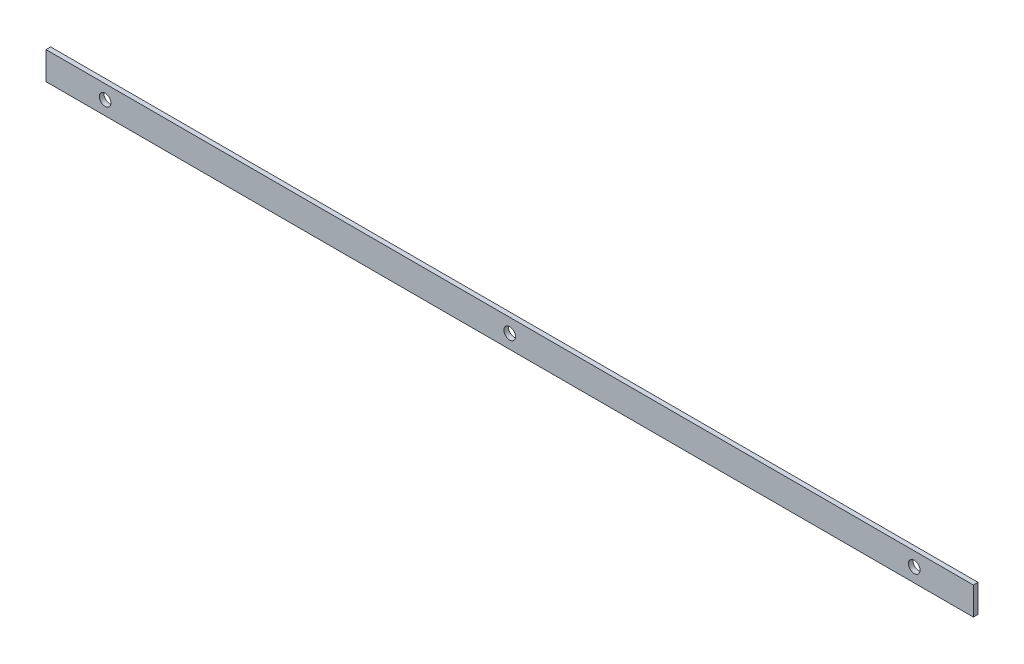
ISO-10303-21;
HEADER;
FILE_DESCRIPTION(('STEP AP214'),'2;1');
FILE_NAME('part.step','',(''),(''),'','','');
FILE_SCHEMA(('AUTOMOTIVE_DESIGN { 1 0 10303 214 1 1 1 1 }'));
ENDSEC;
DATA;
#1=APPLICATION_CONTEXT('core data for automotive mechanical design processes');
#2=APPLICATION_PROTOCOL_DEFINITION('international standard','automotive_design',2000,#1);
#3=PRODUCT_CONTEXT('',#1,'mechanical');
#4=PRODUCT('Part','Part','',(#3));
#5=PRODUCT_RELATED_PRODUCT_CATEGORY('part','',(#4));
#6=PRODUCT_DEFINITION_FORMATION('','',#4);
#7=PRODUCT_DEFINITION_CONTEXT('part definition',#1,'design');
#8=PRODUCT_DEFINITION('design','',#6,#7);
#9=PRODUCT_DEFINITION_SHAPE('','',#8);
#10=(LENGTH_UNIT() NAMED_UNIT(*) SI_UNIT(.MILLI.,.METRE.));
#11=(NAMED_UNIT(*) PLANE_ANGLE_UNIT() SI_UNIT($,.RADIAN.));
#12=(NAMED_UNIT(*) SI_UNIT($,.STERADIAN.) SOLID_ANGLE_UNIT());
#13=UNCERTAINTY_MEASURE_WITH_UNIT(LENGTH_MEASURE(1.E-05),#10,'distance_accuracy_value','');
#14=(GEOMETRIC_REPRESENTATION_CONTEXT(3) GLOBAL_UNCERTAINTY_ASSIGNED_CONTEXT((#13)) GLOBAL_UNIT_ASSIGNED_CONTEXT((#10,
#11,#12)) REPRESENTATION_CONTEXT('',''));
#15=CARTESIAN_POINT('',(0.,0.,0.));
#16=DIRECTION('',(0.,0.,1.));
#17=DIRECTION('',(1.,0.,0.));
#18=AXIS2_PLACEMENT_3D('',#15,#16,#17);
#19=CARTESIAN_POINT('',(0.,0.,4.));
#20=DIRECTION('',(-1.,0.,0.));
#21=DIRECTION('',(0.,0.,1.));
#22=AXIS2_PLACEMENT_3D('',#19,#20,#21);
#23=PLANE('',#22);
#24=DIRECTION('',(0.,1.,0.));
#25=VECTOR('',#24,1.);
#26=CARTESIAN_POINT('',(0.,0.,0.));
#27=LINE('',#26,#25);
#28=CARTESIAN_POINT('',(0.,0.,0.));
#29=VERTEX_POINT('',#28);
#30=CARTESIAN_POINT('',(0.,24.,0.));
#31=VERTEX_POINT('',#30);
#32=EDGE_CURVE('E71',#29,#31,#27,.T.);
#33=ORIENTED_EDGE('',*,*,#32,.T.);
#34=DIRECTION('',(0.,0.,-1.));
#35=VECTOR('',#34,1.);
#36=CARTESIAN_POINT('',(0.,24.,4.));
#37=LINE('',#36,#35);
#38=CARTESIAN_POINT('',(0.,24.,4.));
#39=VERTEX_POINT('',#38);
#40=EDGE_CURVE('E11',#39,#31,#37,.T.);
#41=ORIENTED_EDGE('',*,*,#40,.F.);
#42=DIRECTION('',(0.,1.,0.));
#43=VECTOR('',#42,1.);
#44=CARTESIAN_POINT('',(0.,0.,4.));
#45=LINE('',#44,#43);
#46=CARTESIAN_POINT('',(0.,0.,4.));
#47=VERTEX_POINT('',#46);
#48=EDGE_CURVE('E94',#47,#39,#45,.T.);
#49=ORIENTED_EDGE('',*,*,#48,.F.);
#50=DIRECTION('',(0.,0.,-1.));
#51=VECTOR('',#50,1.);
#52=CARTESIAN_POINT('',(0.,0.,4.));
#53=LINE('',#52,#51);
#54=EDGE_CURVE('E83',#47,#29,#53,.T.);
#55=ORIENTED_EDGE('',*,*,#54,.T.);
#56=EDGE_LOOP('',(#33,#41,#49,#55));
#57=FACE_BOUND('',#56,.T.);
#58=ADVANCED_FACE('F27',(#57),#23,.F.);
#59=CARTESIAN_POINT('',(0.,24.,4.));
#60=DIRECTION('',(0.,-1.,0.));
#61=DIRECTION('',(1.,0.,0.));
#62=AXIS2_PLACEMENT_3D('',#59,#60,#61);
#63=PLANE('',#62);
#64=DIRECTION('',(-1.,0.,0.));
#65=VECTOR('',#64,1.);
#66=CARTESIAN_POINT('',(0.,24.,0.));
#67=LINE('',#66,#65);
#68=CARTESIAN_POINT('',(-800.,23.9999999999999,0.));
#69=VERTEX_POINT('',#68);
#70=EDGE_CURVE('E67',#31,#69,#67,.T.);
#71=ORIENTED_EDGE('',*,*,#70,.T.);
#72=DIRECTION('',(0.,0.,-1.));
#73=VECTOR('',#72,1.);
#74=CARTESIAN_POINT('',(-800.,23.9999999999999,4.));
#75=LINE('',#74,#73);
#76=CARTESIAN_POINT('',(-800.,23.9999999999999,4.));
#77=VERTEX_POINT('',#76);
#78=EDGE_CURVE('E34',#77,#69,#75,.T.);
#79=ORIENTED_EDGE('',*,*,#78,.F.);
#80=DIRECTION('',(-1.,0.,0.));
#81=VECTOR('',#80,1.);
#82=CARTESIAN_POINT('',(0.,24.,4.));
#83=LINE('',#82,#81);
#84=EDGE_CURVE('E79',#39,#77,#83,.T.);
#85=ORIENTED_EDGE('',*,*,#84,.F.);
#86=ORIENTED_EDGE('',*,*,#40,.T.);
#87=EDGE_LOOP('',(#71,#79,#85,#86));
#88=FACE_BOUND('',#87,.T.);
#89=ADVANCED_FACE('F78',(#88),#63,.F.);
#90=CARTESIAN_POINT('',(-800.,0.,4.));
#91=DIRECTION('',(1.,0.,0.));
#92=DIRECTION('',(0.,0.,-1.));
#93=AXIS2_PLACEMENT_3D('',#90,#91,#92);
#94=PLANE('',#93);
#95=DIRECTION('',(0.,-1.,0.));
#96=VECTOR('',#95,1.);
#97=CARTESIAN_POINT('',(-800.,0.,0.));
#98=LINE('',#97,#96);
#99=CARTESIAN_POINT('',(-800.,0.,0.));
#100=VERTEX_POINT('',#99);
#101=EDGE_CURVE('E72',#69,#100,#98,.T.);
#102=ORIENTED_EDGE('',*,*,#101,.T.);
#103=DIRECTION('',(0.,0.,-1.));
#104=VECTOR('',#103,1.);
#105=CARTESIAN_POINT('',(-800.,0.,4.));
#106=LINE('',#105,#104);
#107=CARTESIAN_POINT('',(-800.,0.,4.));
#108=VERTEX_POINT('',#107);
#109=EDGE_CURVE('E100',#108,#100,#106,.T.);
#110=ORIENTED_EDGE('',*,*,#109,.F.);
#111=DIRECTION('',(0.,-1.,0.));
#112=VECTOR('',#111,1.);
#113=CARTESIAN_POINT('',(-800.,0.,4.));
#114=LINE('',#113,#112);
#115=EDGE_CURVE('E46',#77,#108,#114,.T.);
#116=ORIENTED_EDGE('',*,*,#115,.F.);
#117=ORIENTED_EDGE('',*,*,#78,.T.);
#118=EDGE_LOOP('',(#102,#110,#116,#117));
#119=FACE_BOUND('',#118,.T.);
#120=ADVANCED_FACE('F103',(#119),#94,.F.);
#121=CARTESIAN_POINT('',(0.,0.,4.));
#122=DIRECTION('',(0.,1.,0.));
#123=DIRECTION('',(-1.,0.,0.));
#124=AXIS2_PLACEMENT_3D('',#121,#122,#123);
#125=PLANE('',#124);
#126=DIRECTION('',(1.,0.,0.));
#127=VECTOR('',#126,1.);
#128=CARTESIAN_POINT('',(0.,0.,0.));
#129=LINE('',#128,#127);
#130=EDGE_CURVE('E92',#100,#29,#129,.T.);
#131=ORIENTED_EDGE('',*,*,#130,.T.);
#132=ORIENTED_EDGE('',*,*,#54,.F.);
#133=DIRECTION('',(1.,0.,0.));
#134=VECTOR('',#133,1.);
#135=CARTESIAN_POINT('',(0.,0.,4.));
#136=LINE('',#135,#134);
#137=EDGE_CURVE('E41',#108,#47,#136,.T.);
#138=ORIENTED_EDGE('',*,*,#137,.F.);
#139=ORIENTED_EDGE('',*,*,#109,.T.);
#140=EDGE_LOOP('',(#131,#132,#138,#139));
#141=FACE_BOUND('',#140,.T.);
#142=ADVANCED_FACE('F105',(#141),#125,.F.);
#143=CARTESIAN_POINT('',(0.,24.,4.));
#144=DIRECTION('',(0.,0.,1.));
#145=DIRECTION('',(1.,0.,0.));
#146=AXIS2_PLACEMENT_3D('',#143,#144,#145);
#147=PLANE('',#146);
#148=CARTESIAN_POINT('',(-51.,12.,4.));
#149=DIRECTION('',(0.,0.,1.));
#150=DIRECTION('',(1.,0.,0.));
#151=AXIS2_PLACEMENT_3D('',#148,#149,#150);
#152=CIRCLE('',#151,5.);
#153=CARTESIAN_POINT('',(-46.,12.,4.));
#154=VERTEX_POINT('',#153);
#155=EDGE_CURVE('E170',#154,#154,#152,.T.);
#156=ORIENTED_EDGE('',*,*,#155,.F.);
#157=EDGE_LOOP('',(#156));
#158=FACE_BOUND('',#157,.T.);
#159=CARTESIAN_POINT('',(-400.,12.,4.));
#160=DIRECTION('',(0.,0.,1.));
#161=DIRECTION('',(1.,0.,0.));
#162=AXIS2_PLACEMENT_3D('',#159,#160,#161);
#163=CIRCLE('',#162,4.99999999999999);
#164=CARTESIAN_POINT('',(-395.,12.,4.));
#165=VERTEX_POINT('',#164);
#166=EDGE_CURVE('E172',#165,#165,#163,.T.);
#167=ORIENTED_EDGE('',*,*,#166,.F.);
#168=EDGE_LOOP('',(#167));
#169=FACE_BOUND('',#168,.T.);
#170=CARTESIAN_POINT('',(-749.,12.,4.));
#171=DIRECTION('',(0.,0.,1.));
#172=DIRECTION('',(1.,0.,0.));
#173=AXIS2_PLACEMENT_3D('',#170,#171,#172);
#174=CIRCLE('',#173,5.00000000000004);
#175=CARTESIAN_POINT('',(-744.,12.,4.));
#176=VERTEX_POINT('',#175);
#177=EDGE_CURVE('E87',#176,#176,#174,.T.);
#178=ORIENTED_EDGE('',*,*,#177,.F.);
#179=EDGE_LOOP('',(#178));
#180=FACE_BOUND('',#179,.T.);
#181=ORIENTED_EDGE('',*,*,#48,.T.);
#182=ORIENTED_EDGE('',*,*,#84,.T.);
#183=ORIENTED_EDGE('',*,*,#115,.T.);
#184=ORIENTED_EDGE('',*,*,#137,.T.);
#185=EDGE_LOOP('',(#181,#182,#183,#184));
#186=FACE_BOUND('',#185,.T.);
#187=ADVANCED_FACE('F106',(#158,#169,#180,#186),#147,.T.);
#188=CARTESIAN_POINT('',(0.,24.,0.));
#189=DIRECTION('',(0.,0.,1.));
#190=DIRECTION('',(1.,0.,0.));
#191=AXIS2_PLACEMENT_3D('',#188,#189,#190);
#192=PLANE('',#191);
#193=CARTESIAN_POINT('',(-51.,12.,0.));
#194=DIRECTION('',(0.,0.,1.));
#195=DIRECTION('',(1.,0.,0.));
#196=AXIS2_PLACEMENT_3D('',#193,#194,#195);
#197=CIRCLE('',#196,5.);
#198=CARTESIAN_POINT('',(-46.,12.,0.));
#199=VERTEX_POINT('',#198);
#200=EDGE_CURVE('E168',#199,#199,#197,.T.);
#201=ORIENTED_EDGE('',*,*,#200,.T.);
#202=EDGE_LOOP('',(#201));
#203=FACE_BOUND('',#202,.T.);
#204=CARTESIAN_POINT('',(-400.,12.,0.));
#205=DIRECTION('',(0.,0.,1.));
#206=DIRECTION('',(1.,0.,0.));
#207=AXIS2_PLACEMENT_3D('',#204,#205,#206);
#208=CIRCLE('',#207,4.99999999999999);
#209=CARTESIAN_POINT('',(-395.,12.,0.));
#210=VERTEX_POINT('',#209);
#211=EDGE_CURVE('E177',#210,#210,#208,.T.);
#212=ORIENTED_EDGE('',*,*,#211,.T.);
#213=EDGE_LOOP('',(#212));
#214=FACE_BOUND('',#213,.T.);
#215=CARTESIAN_POINT('',(-749.,12.,0.));
#216=DIRECTION('',(0.,0.,1.));
#217=DIRECTION('',(1.,0.,0.));
#218=AXIS2_PLACEMENT_3D('',#215,#216,#217);
#219=CIRCLE('',#218,5.00000000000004);
#220=CARTESIAN_POINT('',(-744.,12.,0.));
#221=VERTEX_POINT('',#220);
#222=EDGE_CURVE('E84',#221,#221,#219,.T.);
#223=ORIENTED_EDGE('',*,*,#222,.T.);
#224=EDGE_LOOP('',(#223));
#225=FACE_BOUND('',#224,.T.);
#226=ORIENTED_EDGE('',*,*,#32,.F.);
#227=ORIENTED_EDGE('',*,*,#130,.F.);
#228=ORIENTED_EDGE('',*,*,#101,.F.);
#229=ORIENTED_EDGE('',*,*,#70,.F.);
#230=EDGE_LOOP('',(#226,#227,#228,#229));
#231=FACE_BOUND('',#230,.T.);
#232=ADVANCED_FACE('F68',(#203,#214,#225,#231),#192,.F.);
#233=CARTESIAN_POINT('',(-749.,12.,0.));
#234=DIRECTION('',(0.,0.,1.));
#235=DIRECTION('',(1.,0.,0.));
#236=AXIS2_PLACEMENT_3D('',#233,#234,#235);
#237=CYLINDRICAL_SURFACE('',#236,5.00000000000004);
#238=ORIENTED_EDGE('',*,*,#222,.F.);
#239=EDGE_LOOP('',(#238));
#240=FACE_BOUND('',#239,.T.);
#241=ORIENTED_EDGE('',*,*,#177,.T.);
#242=EDGE_LOOP('',(#241));
#243=FACE_BOUND('',#242,.T.);
#244=ADVANCED_FACE('F114',(#240,#243),#237,.F.);
#245=CARTESIAN_POINT('',(-400.,12.,0.));
#246=DIRECTION('',(0.,0.,1.));
#247=DIRECTION('',(1.,0.,0.));
#248=AXIS2_PLACEMENT_3D('',#245,#246,#247);
#249=CYLINDRICAL_SURFACE('',#248,4.99999999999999);
#250=ORIENTED_EDGE('',*,*,#211,.F.);
#251=EDGE_LOOP('',(#250));
#252=FACE_BOUND('',#251,.T.);
#253=ORIENTED_EDGE('',*,*,#166,.T.);
#254=EDGE_LOOP('',(#253));
#255=FACE_BOUND('',#254,.T.);
#256=ADVANCED_FACE('F147',(#252,#255),#249,.F.);
#257=CARTESIAN_POINT('',(-51.,12.,0.));
#258=DIRECTION('',(0.,0.,1.));
#259=DIRECTION('',(1.,0.,0.));
#260=AXIS2_PLACEMENT_3D('',#257,#258,#259);
#261=CYLINDRICAL_SURFACE('',#260,5.);
#262=ORIENTED_EDGE('',*,*,#200,.F.);
#263=EDGE_LOOP('',(#262));
#264=FACE_BOUND('',#263,.T.);
#265=ORIENTED_EDGE('',*,*,#155,.T.);
#266=EDGE_LOOP('',(#265));
#267=FACE_BOUND('',#266,.T.);
#268=ADVANCED_FACE('F155',(#264,#267),#261,.F.);
#269=CLOSED_SHELL('',(#58,#89,#120,#142,#187,#232,#244,#256,#268));
#270=MANIFOLD_SOLID_BREP('B2',#269);
#271=ADVANCED_BREP_SHAPE_REPRESENTATION('',(#18,#270),#14);
#272=SHAPE_DEFINITION_REPRESENTATION(#9,#271);
ENDSEC;
END-ISO-10303-21;
